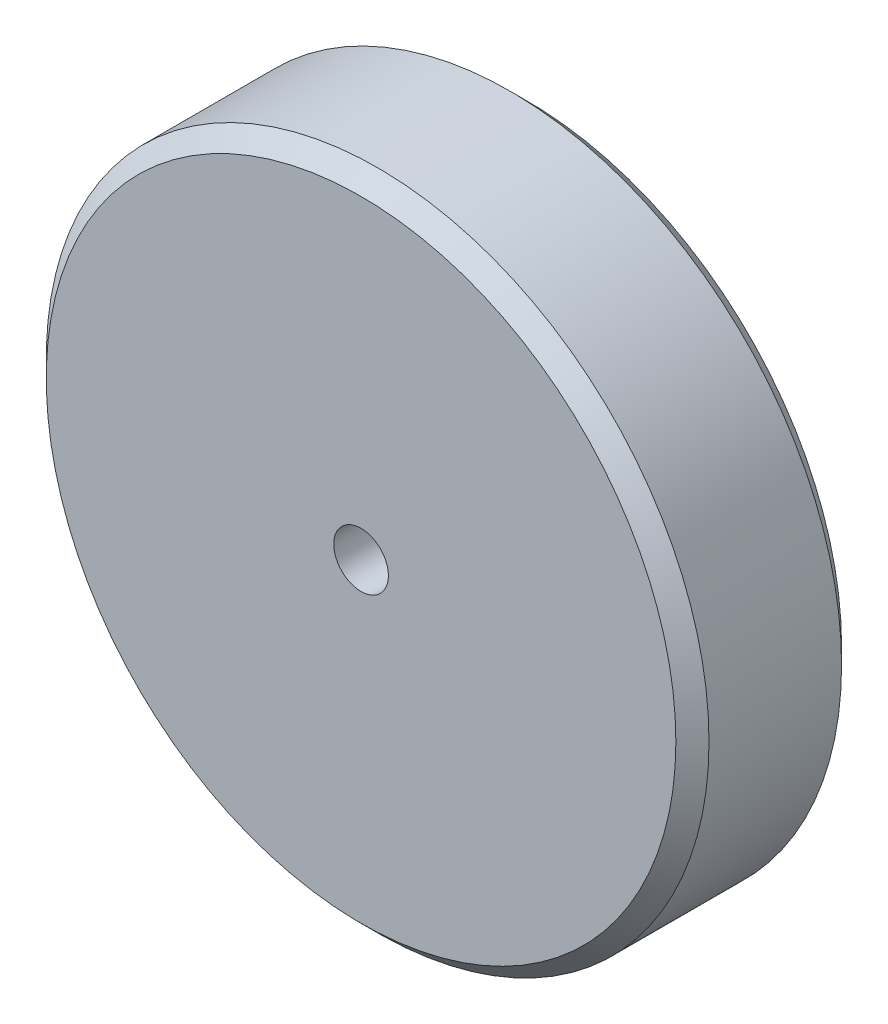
from build123d import *

# Parameters (mm, degrees)
SKETCH1_R                   = 20
EXTRUDE1_DEPTH              = 10
M4_TAPPED_HOLE1_D           = 3.3
M4_TAPPED_HOLE1_ON_FACE_2_D = 3.3
CHAMFER1_SIZE               = 1


with BuildPart() as part:
    # Sketch1 → Extrude1 (new body)
    with BuildSketch(Plane.XY):
        Circle(SKETCH1_R)
    extrude(amount=EXTRUDE1_DEPTH)

    # M4 Tapped Hole1 (through all)
    with Locations(Plane(origin=(0, 0, 0), x_dir=(-1, 0, 0), z_dir=(0, 0, -1))):
        with Locations((0, 0)):
            Hole(M4_TAPPED_HOLE1_D / 2)

    # M4 Tapped Hole1 on face 2 (through all)
    with Locations(Plane.XY.offset(10)):
        with Locations((0, 0)):
            Hole(M4_TAPPED_HOLE1_ON_FACE_2_D / 2)

    # Chamfer1
    chamfer1_edges = [part.edges().sort_by_distance(p)[0] for p in [
        (-20, 0, 0),
        (-20, 0, 10),
    ]]
    chamfer(chamfer1_edges, length=CHAMFER1_SIZE)


solid = part.part
